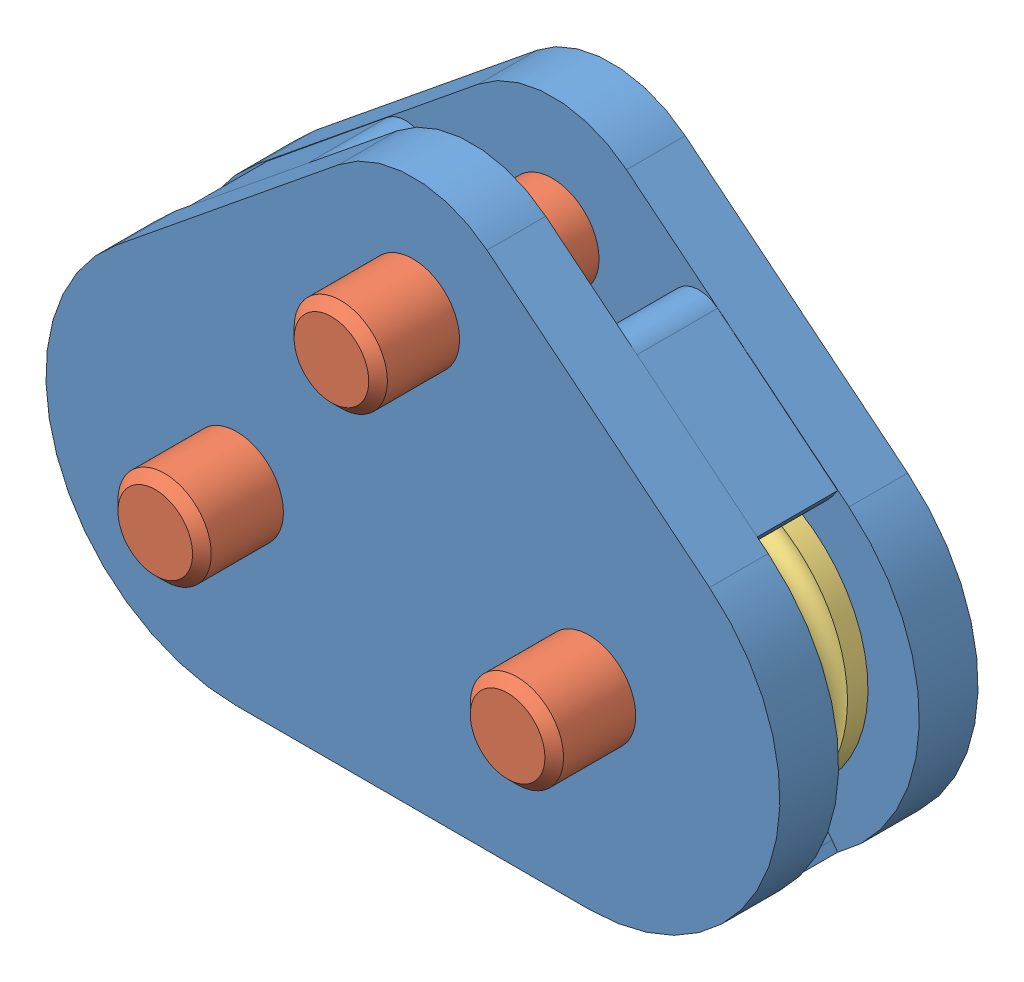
SolidWorks assembly block_drive.SLDASM, configuration Default (file format 5000). Lengths in mm.
Overall size (25 18.6 9.53).
7 component instances, 3 part files, 13 mates.
Components (placement in the parent):
- b1-1: b1.SLDPRT [Default] at (-6.4983 -1.2881 0.0269) size (25 18.6 4.75)
- b1-2: b1.SLDPRT [Default] at (-6.4983 -1.2881 6.7769) x (-1 0 0) z (0 0 -1) size (25 18.6 4.75)
- 97395A435-1: 97395A435.SLDPRT [97395A435] at (-6.4983 6.8119 4.7894) x (0 0 -1) z (1 0 0) size (9.53 3.17 3.17)
- 97395A435-2: 97395A435.SLDPRT [97395A435] at (-0.4983 -1.2881 4.7894) x (0 0 -1) z (1 0 0) size (9.53 3.17 3.17)
- 97395A435-3: 97395A435.SLDPRT [97395A435] at (-12.4983 -1.2881 4.7894) x (0 0 -1) z (1 0 0) size (9.53 3.17 3.17)
- pulley-1: pulley.SLDPRT [Default] at (-12.4983 -1.2881 3.2269) x (1 0 0) z (0 1 0) size (9.5 2.4 9.5)
- pulley-2: pulley.SLDPRT [Default] at (-0.4983 -1.2881 3.2269) x (1 0 0) z (0 1 0) size (9.5 2.4 9.5)
Mates (geometry in assembly coordinates):
- Concentric1: concentric anti-aligned: cylinder of b1-1 through (-0.4983 -1.2881 0.0269) axis (0 0 1) radius 1.5; cylinder of 97395A435-2 through (-0.4983 -1.2881 9.5519) axis (0 0 -1) radius 1.5875
- Concentric2: concentric anti-aligned: cylinder of b1-1 through (-6.4983 6.8119 -21.3709) axis (0 0 1) radius 1.5; cylinder of 97395A435-1 through (-6.4983 6.8119 9.5519) axis (0 0 -1) radius 1.5875
- Concentric3: concentric anti-aligned: cylinder of b1-1 through (-12.4983 -1.2881 0.0269) axis (0 0 1) radius 1.5; cylinder of 97395A435-3 through (-12.4983 -1.2881 9.5519) axis (0 0 -1) radius 1.5875
- Concentric4: concentric anti-aligned: cylinder of 97395A435-2 through (-0.4983 -1.2881 9.5519) axis (0 0 -1) radius 1.5875; cylinder of pulley-2 through (-0.4983 -1.2881 3.2269) axis (0 0 1) radius 1.5
- Concentric5: concentric anti-aligned: cylinder of 97395A435-3 through (-12.4983 -1.2881 9.5519) axis (0 0 -1) radius 1.5875; cylinder of pulley-1 through (-12.4983 -1.2881 3.2269) axis (0 0 1) radius 1.5
- Concentric6: concentric anti-aligned: cylinder of b1-1 through (-12.4983 -1.2881 0.0269) axis (0 0 1) radius 1.5; cylinder of b1-2 through (-12.4983 -1.2881 6.7769) axis (0 0 -1) radius 1.5
- Concentric7: concentric anti-aligned: cylinder of b1-1 through (-0.4983 -1.2881 0.0269) axis (0 0 1) radius 1.5; cylinder of b1-2 through (-0.4983 -1.2881 6.7769) axis (0 0 -1) radius 1.5
- Coincident1: coincident anti-aligned: plane of b1-1 through (-12.4983 -1.2881 2.0269) normal (0 0 1); plane of b1-2 through (-6.4983 -1.2881 2.0269) normal (0 0 -1)
- Coincident2: coincident aligned: plane of b1-1 through (-12.4983 -1.2881 0.0269) normal (0 0 -1); plane of 97395A435-2 through (-0.4983 -1.2881 0.0269) normal (0 0 -1)
- Coincident3: coincident aligned: plane of b1-1 through (-12.4983 -1.2881 0.0269) normal (0 0 -1); plane of 97395A435-1 through (-6.4983 6.8119 0.0269) normal (0 0 -1)
- Coincident4: coincident aligned: plane of b1-1 through (-12.4983 -1.2881 0.0269) normal (0 0 -1); plane of 97395A435-3 through (-12.4983 -1.2881 0.0269) normal (0 0 -1)
- Coincident5: coincident anti-aligned: plane of b1-1 through (-12.4983 -1.2881 2.0269) normal (0 0 1); plane of pulley-1 through (-10.9983 -1.2881 2.0269) normal (0 0 -1)
- Coincident6: coincident anti-aligned: plane of b1-1 through (-12.4983 -1.2881 2.0269) normal (0 0 1); plane of pulley-2 through (1.0017 -1.2881 2.0269) normal (0 0 -1)
